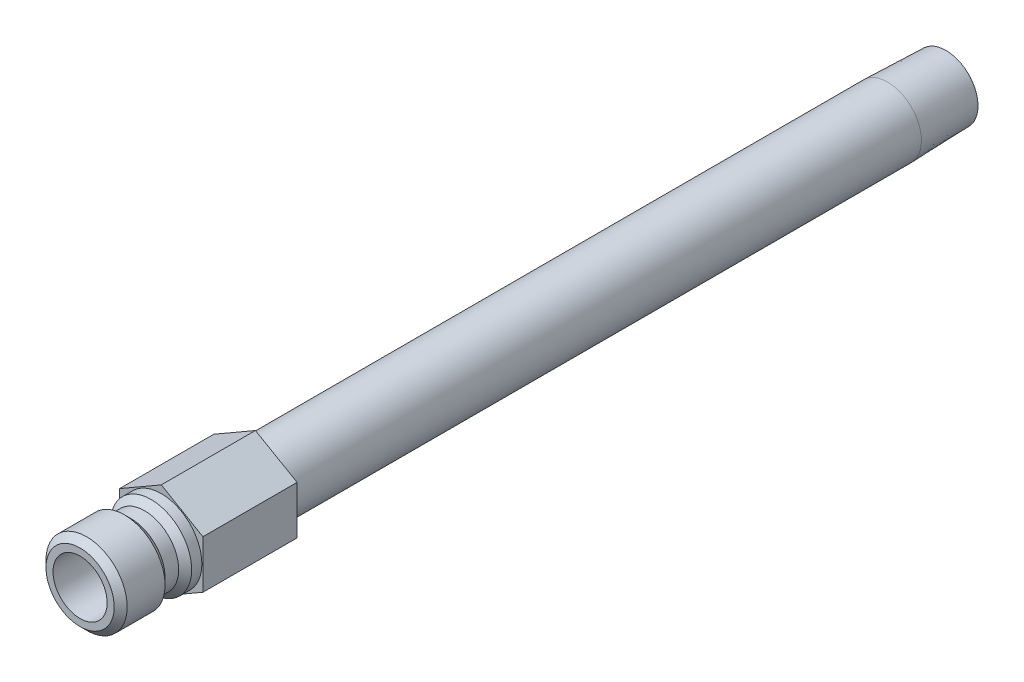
from build123d import *

# Parameters (mm, degrees)
SKETCH2_R           = 2.38125
BOSS_EXTRUDE1_DEPTH = 11.049


with BuildPart() as part:
    # Sketch1 → Revolve1 (revolve)
    with BuildSketch(Plane(origin=(0, 0, 0), x_dir=(0, 0, -1), z_dir=(1, 0, 0))):
        Polygon((-9.525, 3.175), (-9.525, 4.0005), (-8.763, 4.7625), (-4.318, 4.7625), (-3.556, 4.0005), (-1.9558, 4.0005), (-1.1938, 4.7625), (0, 4.7625), (0, 3.96875), (85.217, 3.96875), (92.075, 3.754438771), (92.075, 2.38125), (0.127, 2.38125), (0.127, 3.175), align=None)
    revolve(axis=Axis((0, 0, 0), (0, 0, 1)))

    # Sketch2 → Boss-Extrude1 (add)
    with BuildSketch(Plane.XY):
        Polygon((-4.8895, 2.822954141), (-4.8895, -2.822954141), (0, -5.645908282), (4.8895, -2.822954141), (4.8895, 2.822954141), (0, 5.645908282), align=None)
        with Locations(Location((0, 0, 0), (0, 0, 90))):
            Circle(SKETCH2_R, mode=Mode.SUBTRACT)
    extrude(amount=-BOSS_EXTRUDE1_DEPTH)


solid = part.part
